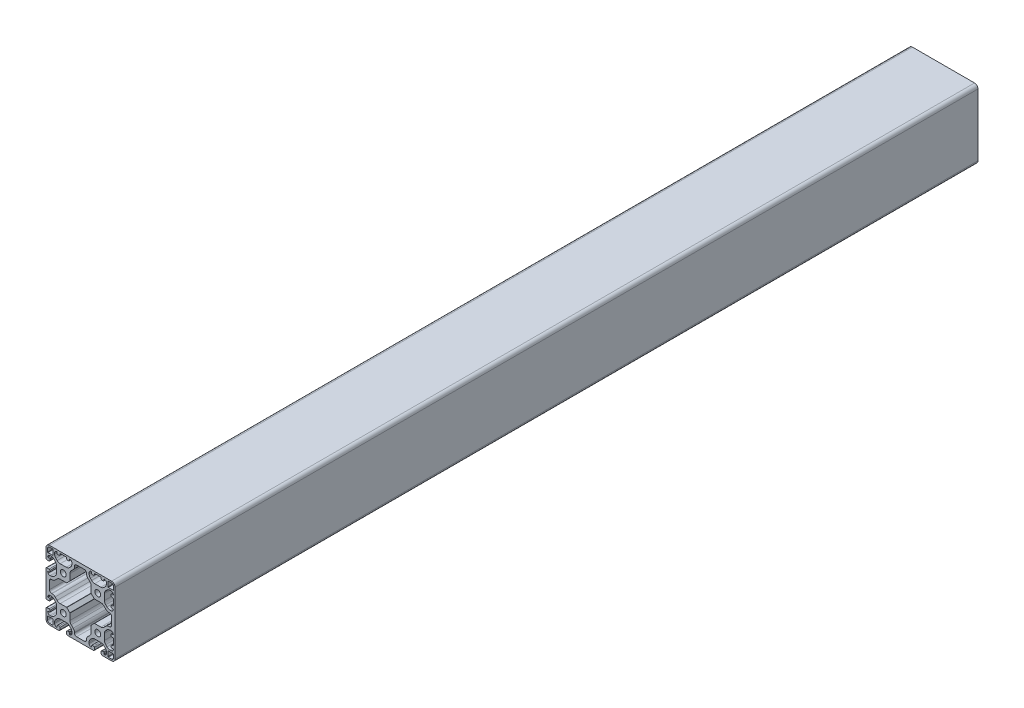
from build123d import *

# Parameters (mm, degrees)
MODEL1_R               = 3.4
STRUKTURBAUTEIL1_DEPTH = 1000


with BuildPart() as part:
    # Model1 → Strukturbauteil1 (new body)
    with BuildSketch(Plane(origin=(0, 0, 0), x_dir=(0, -1, 0), z_dir=(0, 0, -1))):
        with BuildLine():
            Line((30.65685225, -28.53553175), (29.21446125, -27.09314275))
            ThreePointArc((29.21446125, -27.09314275), (28.130599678, -25.471025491), (27.74999925, -23.55760875))
            Line((27.74999925, -23.55760875), (27.74999925, -16.44238675))
            ThreePointArc((27.74999925, -16.44238675), (28.130603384, -14.528969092), (29.21446925, -12.90685275))
            Line((29.21446925, -12.90685275), (30.65685225, -11.46446375))
            ThreePointArc((30.65685225, -11.46446375), (32.278970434, -10.380599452), (34.19238925, -9.99999775))
            Line((34.19238925, -9.99999775), (35.49999925, -9.99999775))
            ThreePointArc((35.49999925, -9.99999775), (37.267766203, -10.732230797), (37.99999925, -12.49999775))
            Line((37.99999925, -12.49999775), (37.99999925, -12.54999675))
            ThreePointArc((37.99999925, -12.54999675), (37.868198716, -12.868194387), (37.55000225, -12.99999775))
            Line((37.55000225, -12.99999775), (35.99999925, -12.99999775))
            ThreePointArc((35.99999925, -12.99999775), (35.646445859, -13.146444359), (35.49999925, -13.49999775))
            Line((35.49999925, -13.49999775), (35.49999925, -14.99999775))
            ThreePointArc((35.49999925, -14.99999775), (35.792892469, -15.707104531), (36.49999925, -15.99999775))
            Line((36.49999925, -15.99999775), (38.99999925, -15.99999775))
            ThreePointArc((38.99999925, -15.99999775), (39.707106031, -15.707104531), (39.99999925, -14.99999775))
            Line((39.99999925, -14.99999775), (39.99999925, 15.00000225))
            ThreePointArc((39.99999925, 15.00000225), (39.707106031, 15.707109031), (38.99999925, 16.00000225))
            Line((38.99999925, 16.00000225), (36.49999925, 16.00000225))
            ThreePointArc((36.49999925, 16.00000225), (35.792892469, 15.707109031), (35.49999925, 15.00000225))
            Line((35.49999925, 15.00000225), (35.49999925, 13.50000225))
            ThreePointArc((35.49999925, 13.50000225), (35.646445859, 13.146448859), (35.99999925, 13.00000225))
            Line((35.99999925, 13.00000225), (37.55000225, 13.00000225))
            ThreePointArc((37.55000225, 13.00000225), (37.868198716, 12.868198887), (37.99999925, 12.55000125))
            Line((37.99999925, 12.55000125), (37.99999925, 12.50000225))
            ThreePointArc((37.99999925, 12.50000225), (37.267766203, 10.732235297), (35.49999925, 10.00000225))
            Line((35.49999925, 10.00000225), (34.19238925, 10.00000225))
            ThreePointArc((34.19238925, 10.00000225), (32.278970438, 10.380603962), (30.65685225, 11.46446825))
            Line((30.65685225, 11.46446825), (29.21446125, 12.90685525))
            ThreePointArc((29.21446125, 12.90685525), (28.130599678, 14.528972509), (27.74999925, 16.44238925))
            Line((27.74999925, 16.44238925), (27.74999925, 23.55761525))
            ThreePointArc((27.74999925, 23.55761525), (28.130603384, 25.471032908), (29.21446925, 27.09314925))
            Line((29.21446925, 27.09314925), (30.65685225, 28.53554025))
            ThreePointArc((30.65685225, 28.53554025), (32.278970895, 29.619402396), (34.19238925, 30.00000225))
            Line((34.19238925, 30.00000225), (35.49999925, 30.00000225))
            ThreePointArc((35.49999925, 30.00000225), (37.267766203, 29.267769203), (37.99999925, 27.50000225))
            Line((37.99999925, 27.50000225), (37.99999925, 27.44999925))
            ThreePointArc((37.99999925, 27.44999925), (37.868197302, 27.131804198), (37.55000225, 27.00000225))
            Line((37.55000225, 27.00000225), (35.99999925, 27.00000225))
            ThreePointArc((35.99999925, 27.00000225), (35.646445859, 26.853555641), (35.49999925, 26.50000225))
            Line((35.49999925, 26.50000225), (35.49999925, 25.00000225))
            ThreePointArc((35.49999925, 25.00000225), (35.792892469, 24.292895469), (36.49999925, 24.00000225))
            Line((36.49999925, 24.00000225), (38.99999925, 24.00000225))
            ThreePointArc((38.99999925, 24.00000225), (39.70710691, 24.292893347), (40.00000225, 24.99999925))
            Line((40.00000225, 24.99999925), (40.00000225, 35.99999925))
            ThreePointArc((40.00000225, 35.99999925), (38.828428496, 38.828425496), (36.00000225, 39.99999925))
            Line((36.00000225, 39.99999925), (25.00000225, 39.99999925))
            ThreePointArc((25.00000225, 39.99999925), (24.292895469, 39.707106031), (24.00000225, 38.99999925))
            Line((24.00000225, 38.99999925), (24.00000225, 36.49999925))
            ThreePointArc((24.00000225, 36.49999925), (24.292895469, 35.792892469), (25.00000225, 35.49999925))
            Line((25.00000225, 35.49999925), (26.50000225, 35.49999925))
            ThreePointArc((26.50000225, 35.49999925), (26.853555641, 35.646445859), (27.00000225, 35.99999925))
            Line((27.00000225, 35.99999925), (27.00000225, 37.55000225))
            ThreePointArc((27.00000225, 37.55000225), (27.131804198, 37.868197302), (27.44999925, 37.99999925))
            Line((27.44999925, 37.99999925), (27.50000225, 37.99999925))
            ThreePointArc((27.50000225, 37.99999925), (29.267769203, 37.267766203), (30.00000225, 35.49999925))
            Line((30.00000225, 35.49999925), (30.00000225, 34.19238925))
            ThreePointArc((30.00000225, 34.19238925), (29.619402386, 32.278970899), (28.53554025, 30.65685225))
            Line((28.53554025, 30.65685225), (27.09314925, 29.21446125))
            ThreePointArc((27.09314925, 29.21446125), (25.471031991, 28.130599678), (23.55761525, 27.74999925))
            Line((23.55761525, 27.74999925), (16.44238925, 27.74999925))
            ThreePointArc((16.44238925, 27.74999925), (14.528971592, 28.130603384), (12.90685525, 29.21446925))
            Line((12.90685525, 29.21446925), (11.46446825, 30.65685225))
            ThreePointArc((11.46446825, 30.65685225), (10.380603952, 32.278970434), (10.00000225, 34.19238925))
            Line((10.00000225, 34.19238925), (10.00000225, 35.49999925))
            ThreePointArc((10.00000225, 35.49999925), (10.732235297, 37.267766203), (12.50000225, 37.99999925))
            Line((12.50000225, 37.99999925), (12.55000125, 37.99999925))
            ThreePointArc((12.55000125, 37.99999925), (12.868198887, 37.868198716), (13.00000225, 37.55000225))
            Line((13.00000225, 37.55000225), (13.00000225, 35.99999925))
            ThreePointArc((13.00000225, 35.99999925), (13.146448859, 35.646445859), (13.50000225, 35.49999925))
            Line((13.50000225, 35.49999925), (15.00000225, 35.49999925))
            ThreePointArc((15.00000225, 35.49999925), (15.707109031, 35.792892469), (16.00000225, 36.49999925))
            Line((16.00000225, 36.49999925), (16.00000225, 38.99999925))
            ThreePointArc((16.00000225, 38.99999925), (15.707109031, 39.707106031), (15.00000225, 39.99999925))
            Line((15.00000225, 39.99999925), (-14.99999775, 39.99999925))
            ThreePointArc((-14.99999775, 39.99999925), (-15.707104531, 39.707106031), (-15.99999775, 38.99999925))
            Line((-15.99999775, 38.99999925), (-15.99999775, 36.49999925))
            ThreePointArc((-15.99999775, 36.49999925), (-15.707104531, 35.792892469), (-14.99999775, 35.49999925))
            Line((-14.99999775, 35.49999925), (-13.49999775, 35.49999925))
            ThreePointArc((-13.49999775, 35.49999925), (-13.146444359, 35.646445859), (-12.99999775, 35.99999925))
            Line((-12.99999775, 35.99999925), (-12.99999775, 37.55000225))
            ThreePointArc((-12.99999775, 37.55000225), (-12.868194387, 37.868198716), (-12.54999675, 37.99999925))
            Line((-12.54999675, 37.99999925), (-12.49999775, 37.99999925))
            ThreePointArc((-12.49999775, 37.99999925), (-10.732230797, 37.267766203), (-9.99999775, 35.49999925))
            Line((-9.99999775, 35.49999925), (-9.99999775, 34.19238925))
            ThreePointArc((-9.99999775, 34.19238925), (-10.380599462, 32.278970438), (-11.46446375, 30.65685225))
            Line((-11.46446375, 30.65685225), (-12.90685275, 29.21446125))
            ThreePointArc((-12.90685275, 29.21446125), (-14.528970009, 28.130599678), (-16.44238675, 27.74999925))
            Line((-16.44238675, 27.74999925), (-23.55760875, 27.74999925))
            ThreePointArc((-23.55760875, 27.74999925), (-25.471026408, 28.130603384), (-27.09314275, 29.21446925))
            Line((-27.09314275, 29.21446925), (-28.53553175, 30.65685225))
            ThreePointArc((-28.53553175, 30.65685225), (-29.619396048, 32.278970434), (-29.99999775, 34.19238925))
            Line((-29.99999775, 34.19238925), (-29.99999775, 35.49999925))
            ThreePointArc((-29.99999775, 35.49999925), (-29.267764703, 37.267766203), (-27.49999775, 37.99999925))
            Line((-27.49999775, 37.99999925), (-27.44999775, 37.99999925))
            ThreePointArc((-27.44999775, 37.99999925), (-27.131800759, 37.868198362), (-26.99999775, 37.55000225))
            Line((-26.99999775, 37.55000225), (-26.99999775, 35.99999925))
            ThreePointArc((-26.99999775, 35.99999925), (-26.853551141, 35.646445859), (-26.49999775, 35.49999925))
            Line((-26.49999775, 35.49999925), (-24.99999775, 35.49999925))
            ThreePointArc((-24.99999775, 35.49999925), (-24.292890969, 35.792892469), (-23.99999775, 36.49999925))
            Line((-23.99999775, 36.49999925), (-23.99999775, 38.99999925))
            ThreePointArc((-23.99999775, 38.99999925), (-24.292890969, 39.707106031), (-24.99999775, 39.99999925))
            Line((-24.99999775, 39.99999925), (-35.99999775, 39.99999925))
            ThreePointArc((-35.99999775, 39.99999925), (-38.828424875, 38.828426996), (-39.99999925, 36.00000075))
            Line((-39.99999925, 36.00000075), (-39.99999925, -35.99999925))
            ThreePointArc((-39.99999925, -35.99999925), (-38.828426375, -38.828426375), (-35.99999925, -39.99999925))
            Line((-35.99999925, -39.99999925), (36.00000075, -39.99999925))
            ThreePointArc((36.00000075, -39.99999925), (38.828426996, -38.828424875), (39.99999925, -35.99999775))
            Line((39.99999925, -35.99999775), (39.99999925, -24.99999775))
            ThreePointArc((39.99999925, -24.99999775), (39.707106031, -24.292890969), (38.99999925, -23.99999775))
            Line((38.99999925, -23.99999775), (36.49999925, -23.99999775))
            ThreePointArc((36.49999925, -23.99999775), (35.792892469, -24.292890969), (35.49999925, -24.99999775))
            Line((35.49999925, -24.99999775), (35.49999925, -26.49999775))
            ThreePointArc((35.49999925, -26.49999775), (35.646445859, -26.853551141), (35.99999925, -26.99999775))
            Line((35.99999925, -26.99999775), (37.55000225, -26.99999775))
            ThreePointArc((37.55000225, -26.99999775), (37.868198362, -27.131800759), (37.99999925, -27.44999775))
            Line((37.99999925, -27.44999775), (37.99999925, -27.49999775))
            ThreePointArc((37.99999925, -27.49999775), (37.267766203, -29.267764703), (35.49999925, -29.99999775))
            Line((35.49999925, -29.99999775), (34.19238925, -29.99999775))
            ThreePointArc((34.19238925, -29.99999775), (32.278970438, -29.619396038), (30.65685225, -28.53553175))
        make_face()
        with Locations((-19.99999925, -19.99999925)):
            Circle(MODEL1_R, mode=Mode.SUBTRACT)
        with Locations((-19.99999925, 20.00000075)):
            Circle(MODEL1_R, mode=Mode.SUBTRACT)
        with Locations((20.00000075, -19.99999925)):
            Circle(MODEL1_R, mode=Mode.SUBTRACT)
        with Locations((20.00000075, 20.00000075)):
            Circle(MODEL1_R, mode=Mode.SUBTRACT)
        with BuildLine():
            Line((-29.21446525, 27.09314775), (-30.65685425, 28.53553875))
            ThreePointArc((-30.65685425, 28.53553875), (-32.278971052, 29.61940012), (-34.19238725, 30.00000075))
            Line((-34.19238725, 30.00000075), (-35.49999925, 30.00000075))
            ThreePointArc((-35.49999925, 30.00000075), (-37.267766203, 29.267767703), (-37.99999925, 27.50000075))
            ThreePointArc((-37.99999925, 27.50000075), (-37.853552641, 27.146447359), (-37.49999925, 27.00000075))
            Line((-37.49999925, 27.00000075), (-35.99999925, 27.00000075))
            ThreePointArc((-35.99999925, 27.00000075), (-35.646445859, 26.853554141), (-35.49999925, 26.50000075))
            Line((-35.49999925, 26.50000075), (-35.49999925, 25.00000075))
            ThreePointArc((-35.49999925, 25.00000075), (-35.792892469, 24.292893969), (-36.49999925, 24.00000075))
            Line((-36.49999925, 24.00000075), (-37.49999925, 24.00000075))
            ThreePointArc((-37.49999925, 24.00000075), (-37.853552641, 23.853554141), (-37.99999925, 23.50000075))
            Line((-37.99999925, 23.50000075), (-37.99999925, 16.50000075))
            ThreePointArc((-37.99999925, 16.50000075), (-37.853552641, 16.146447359), (-37.49999925, 16.00000075))
            Line((-37.49999925, 16.00000075), (-36.49999925, 16.00000075))
            ThreePointArc((-36.49999925, 16.00000075), (-35.792892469, 15.707107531), (-35.49999925, 15.00000075))
            Line((-35.49999925, 15.00000075), (-35.49999925, 13.50000075))
            ThreePointArc((-35.49999925, 13.50000075), (-35.646445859, 13.146447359), (-35.99999925, 13.00000075))
            Line((-35.99999925, 13.00000075), (-37.49999925, 13.00000075))
            ThreePointArc((-37.49999925, 13.00000075), (-37.853552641, 12.853554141), (-37.99999925, 12.50000075))
            ThreePointArc((-37.99999925, 12.50000075), (-37.267766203, 10.732233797), (-35.49999925, 10.00000075))
            Line((-35.49999925, 10.00000075), (-34.19238725, 10.00000075))
            ThreePointArc((-34.19238725, 10.00000075), (-32.278970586, 10.380603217), (-30.65685425, 11.46446675))
            Line((-30.65685425, 11.46446675), (-29.21446525, 12.90685375))
            ThreePointArc((-29.21446525, 12.90685375), (-28.130601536, 14.528970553), (-27.74999925, 16.44238775))
            Line((-27.74999925, 16.44238775), (-27.74999925, 23.55761375))
            ThreePointArc((-27.74999925, 23.55761375), (-28.130601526, 25.471030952), (-29.21446525, 27.09314775))
        make_face(mode=Mode.SUBTRACT)
        with BuildLine():
            Line((-11.46446525, -30.65685425), (-12.90685425, -29.21446525))
            ThreePointArc((-12.90685425, -29.21446525), (-14.528971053, -28.130601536), (-16.44238825, -27.74999925))
            Line((-16.44238825, -27.74999925), (-23.55761025, -27.74999925))
            ThreePointArc((-23.55761025, -27.74999925), (-25.471027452, -28.130601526), (-27.09314425, -29.21446525))
            Line((-27.09314425, -29.21446525), (-28.53553325, -30.65685425))
            ThreePointArc((-28.53553325, -30.65685425), (-29.619396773, -32.278970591), (-29.99999925, -34.19238725))
            Line((-29.99999925, -34.19238725), (-29.99999925, -35.49999925))
            ThreePointArc((-29.99999925, -35.49999925), (-29.267766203, -37.267766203), (-27.49999925, -37.99999925))
            ThreePointArc((-27.49999925, -37.99999925), (-27.146445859, -37.853552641), (-26.99999925, -37.49999925))
            Line((-26.99999925, -37.49999925), (-26.99999925, -35.99999925))
            ThreePointArc((-26.99999925, -35.99999925), (-26.853552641, -35.646445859), (-26.49999925, -35.49999925))
            Line((-26.49999925, -35.49999925), (-24.99999925, -35.49999925))
            ThreePointArc((-24.99999925, -35.49999925), (-24.292892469, -35.792892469), (-23.99999925, -36.49999925))
            Line((-23.99999925, -36.49999925), (-23.99999925, -37.49999925))
            ThreePointArc((-23.99999925, -37.49999925), (-23.853552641, -37.853552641), (-23.49999925, -37.99999925))
            Line((-23.49999925, -37.99999925), (-16.49999925, -37.99999925))
            ThreePointArc((-16.49999925, -37.99999925), (-16.146445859, -37.853552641), (-15.99999925, -37.49999925))
            Line((-15.99999925, -37.49999925), (-15.99999925, -36.49999925))
            ThreePointArc((-15.99999925, -36.49999925), (-15.707106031, -35.792892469), (-14.99999925, -35.49999925))
            Line((-14.99999925, -35.49999925), (-13.49999925, -35.49999925))
            ThreePointArc((-13.49999925, -35.49999925), (-13.146445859, -35.646445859), (-12.99999925, -35.99999925))
            Line((-12.99999925, -35.99999925), (-12.99999925, -37.49999925))
            ThreePointArc((-12.99999925, -37.49999925), (-12.853552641, -37.853552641), (-12.49999925, -37.99999925))
            ThreePointArc((-12.49999925, -37.99999925), (-10.732232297, -37.267766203), (-9.99999925, -35.49999925))
            Line((-9.99999925, -35.49999925), (-9.99999925, -34.19238725))
            ThreePointArc((-9.99999925, -34.19238725), (-10.380601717, -32.278970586), (-11.46446525, -30.65685425))
        make_face(mode=Mode.SUBTRACT)
        with BuildLine():
            Line((-27.09314425, -10.78553325), (-29.41421225, -8.46446525))
            ThreePointArc((-29.41421225, -8.46446525), (-31.036329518, -7.380601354), (-32.94974725, -6.99999925))
            Line((-32.94974725, -6.99999925), (-33.49999925, -6.99999925))
            ThreePointArc((-33.49999925, -6.99999925), (-35.266966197, -6.266966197), (-35.99999925, -4.49999925))
            Line((-35.99999925, -4.49999925), (-35.99999925, 4.50000075))
            ThreePointArc((-35.99999925, 4.50000075), (-35.267766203, 6.267767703), (-33.49999925, 7.00000075))
            Line((-33.49999925, 7.00000075), (-32.94974725, 7.00000075))
            ThreePointArc((-32.94974725, 7.00000075), (-31.974295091, 7.096074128), (-31.036328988, 7.380602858))
            ThreePointArc((-31.036328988, 7.380602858), (-30.171894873, 7.842652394), (-29.414212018, 8.464466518))
            Line((-29.414212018, 8.464466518), (-27.093144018, 10.785534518))
            ThreePointArc((-27.093144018, 10.785534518), (-25.471027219, 11.869398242), (-23.557610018, 12.250000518))
            Line((-23.557610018, 12.250000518), (-16.241378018, 12.250000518))
            ThreePointArc((-16.241378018, 12.250000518), (-16.050036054, 12.288060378), (-15.887824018, 12.396446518))
            Line((-15.887824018, 12.396446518), (-12.396445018, 15.887825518))
            ThreePointArc((-12.396445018, 15.887825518), (-12.288058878, 16.050037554), (-12.249999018, 16.241379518))
            Line((-12.249999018, 16.241379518), (-12.249999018, 23.557613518))
            ThreePointArc((-12.249999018, 23.557613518), (-12.153925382, 24.533064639), (-11.869396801, 25.471029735))
            ThreePointArc((-11.869396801, 25.471029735), (-11.40734705, 26.3354641), (-10.785532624, 27.093147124))
            Line((-10.785532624, 27.093147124), (-8.464464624, 29.414215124))
            ThreePointArc((-8.464464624, 29.414215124), (-7.380601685, 31.036330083), (-6.999998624, 32.949745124))
            Line((-6.999998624, 32.949745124), (-6.999998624, 33.500000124))
            ThreePointArc((-6.999998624, 33.500000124), (-6.267765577, 35.267767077), (-4.499998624, 36.000000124))
            Line((-4.499998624, 36.000000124), (4.500001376, 36.000000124))
            ThreePointArc((4.500001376, 36.000000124), (6.267768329, 35.267767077), (7.000001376, 33.500000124))
            Line((7.000001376, 33.500000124), (7.000001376, 32.949745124))
            ThreePointArc((7.000001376, 32.949745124), (7.096075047, 31.974294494), (7.380603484, 31.036329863))
            ThreePointArc((7.380603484, 31.036329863), (7.842652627, 30.171896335), (8.464466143, 29.414213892))
            Line((8.464466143, 29.414213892), (10.785534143, 27.093145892))
            ThreePointArc((10.785534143, 27.093145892), (11.869397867, 25.471029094), (12.250000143, 23.557611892))
            Line((12.250000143, 23.557611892), (12.250000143, 16.241377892))
            ThreePointArc((12.250000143, 16.241377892), (12.288060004, 16.050035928), (12.396446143, 15.887823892))
            Line((12.396446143, 15.887823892), (15.887825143, 12.396444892))
            ThreePointArc((15.887825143, 12.396444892), (16.05003718, 12.288058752), (16.241379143, 12.249998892))
            Line((16.241379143, 12.249998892), (23.557613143, 12.249998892))
            ThreePointArc((23.557613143, 12.249998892), (24.533064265, 12.153925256), (25.47102936, 11.869396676))
            ThreePointArc((25.47102936, 11.869396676), (26.335463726, 11.407346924), (27.09314675, 10.785532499))
            Line((27.09314675, 10.785532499), (29.41421475, 8.464464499))
            ThreePointArc((29.41421475, 8.464464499), (31.036329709, 7.380601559), (32.94974475, 6.999998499))
            Line((32.94974475, 6.999998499), (33.49999975, 6.999998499))
            ThreePointArc((33.49999975, 6.999998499), (35.267766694, 6.267766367), (36.000000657, 4.500000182))
            Line((36.000000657, 4.500000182), (36.000000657, -4.499999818))
            ThreePointArc((36.000000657, -4.499999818), (35.26776761, -6.267766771), (33.500000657, -6.999999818))
            Line((33.500000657, -6.999999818), (32.949745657, -6.999999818))
            ThreePointArc((32.949745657, -6.999999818), (31.974295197, -7.096073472), (31.036330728, -7.38060186))
            ThreePointArc((31.036330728, -7.38060186), (30.171897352, -7.842650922), (29.414215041, -8.464464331))
            Line((29.414215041, -8.464464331), (27.093147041, -10.785532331))
            ThreePointArc((27.093147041, -10.785532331), (25.471030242, -11.869396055), (23.557613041, -12.249998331))
            Line((23.557613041, -12.249998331), (16.241379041, -12.249998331))
            ThreePointArc((16.241379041, -12.249998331), (16.050037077, -12.288058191), (15.887825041, -12.396444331))
            Line((15.887825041, -12.396444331), (12.396446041, -15.887823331))
            ThreePointArc((12.396446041, -15.887823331), (12.288059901, -16.050035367), (12.250000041, -16.241377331))
            Line((12.250000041, -16.241377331), (12.250000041, -23.557609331))
            ThreePointArc((12.250000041, -23.557609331), (12.153926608, -24.533061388), (11.869397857, -25.471027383))
            ThreePointArc((11.869397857, -25.471027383), (11.407348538, -26.335461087), (10.785534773, -27.093143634))
            Line((10.785534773, -27.093143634), (8.464466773, -29.414211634))
            ThreePointArc((8.464466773, -29.414211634), (7.380602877, -31.036328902), (7.000000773, -32.949746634))
            Line((7.000000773, -32.949746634), (7.000000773, -33.499998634))
            ThreePointArc((7.000000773, -33.499998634), (6.267767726, -35.267765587), (4.500000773, -35.999998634))
            Line((4.500000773, -35.999998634), (-4.499999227, -35.999998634))
            ThreePointArc((-4.499999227, -35.999998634), (-6.26776618, -35.267765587), (-6.999999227, -33.499998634))
            Line((-6.999999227, -33.499998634), (-6.999999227, -32.949746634))
            ThreePointArc((-6.999999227, -32.949746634), (-7.096072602, -31.974294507), (-7.380601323, -31.036328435))
            ThreePointArc((-7.380601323, -31.036328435), (-7.842650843, -30.171894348), (-8.464464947, -29.414211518))
            Line((-8.464464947, -29.414211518), (-10.785532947, -27.093143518))
            ThreePointArc((-10.785532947, -27.093143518), (-11.869396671, -25.471026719), (-12.249998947, -23.557609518))
            Line((-12.249998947, -23.557609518), (-12.249998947, -16.241377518))
            ThreePointArc((-12.249998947, -16.241377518), (-12.288058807, -16.050035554), (-12.396444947, -15.887823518))
            Line((-12.396444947, -15.887823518), (-15.887823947, -12.396444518))
            ThreePointArc((-15.887823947, -12.396444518), (-16.050035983, -12.288058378), (-16.241377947, -12.249998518))
            Line((-16.241377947, -12.249998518), (-23.557609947, -12.249998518))
            ThreePointArc((-23.557609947, -12.249998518), (-24.533062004, -12.153925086), (-25.471028, -11.869396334))
            ThreePointArc((-25.471028, -11.869396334), (-26.335461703, -11.407347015), (-27.09314425, -10.78553325))
        make_face(mode=Mode.SUBTRACT)
        with BuildLine():
            Line((-29.21446525, -12.90685425), (-30.65685425, -11.46446525))
            ThreePointArc((-30.65685425, -11.46446525), (-32.278970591, -10.380601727), (-34.19238725, -9.99999925))
            Line((-34.19238725, -9.99999925), (-35.49999925, -9.99999925))
            ThreePointArc((-35.49999925, -9.99999925), (-37.267766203, -10.732232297), (-37.99999925, -12.49999925))
            ThreePointArc((-37.99999925, -12.49999925), (-37.853552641, -12.853552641), (-37.49999925, -12.99999925))
            Line((-37.49999925, -12.99999925), (-35.99999925, -12.99999925))
            ThreePointArc((-35.99999925, -12.99999925), (-35.646445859, -13.146445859), (-35.49999925, -13.49999925))
            Line((-35.49999925, -13.49999925), (-35.49999925, -14.99999925))
            ThreePointArc((-35.49999925, -14.99999925), (-35.792892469, -15.707106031), (-36.49999925, -15.99999925))
            Line((-36.49999925, -15.99999925), (-37.49999925, -15.99999925))
            ThreePointArc((-37.49999925, -15.99999925), (-37.853552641, -16.146445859), (-37.99999925, -16.49999925))
            Line((-37.99999925, -16.49999925), (-37.99999925, -23.49999925))
            ThreePointArc((-37.99999925, -23.49999925), (-37.853552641, -23.853552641), (-37.49999925, -23.99999925))
            Line((-37.49999925, -23.99999925), (-36.49999925, -23.99999925))
            ThreePointArc((-36.49999925, -23.99999925), (-35.792892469, -24.292892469), (-35.49999925, -24.99999925))
            Line((-35.49999925, -24.99999925), (-35.49999925, -26.49999925))
            ThreePointArc((-35.49999925, -26.49999925), (-35.646445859, -26.853552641), (-35.99999925, -26.99999925))
            Line((-35.99999925, -26.99999925), (-37.49999925, -26.99999925))
            ThreePointArc((-37.49999925, -26.99999925), (-37.853552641, -27.146445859), (-37.99999925, -27.49999925))
            ThreePointArc((-37.99999925, -27.49999925), (-37.267766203, -29.267766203), (-35.49999925, -29.99999925))
            Line((-35.49999925, -29.99999925), (-34.19238725, -29.99999925))
            ThreePointArc((-34.19238725, -29.99999925), (-32.278970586, -29.619396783), (-30.65685425, -28.53553325))
            Line((-30.65685425, -28.53553325), (-29.21446525, -27.09314425))
            ThreePointArc((-29.21446525, -27.09314425), (-28.130601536, -25.471027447), (-27.74999925, -23.55761025))
            Line((-27.74999925, -23.55761025), (-27.74999925, -16.44238825))
            ThreePointArc((-27.74999925, -16.44238825), (-28.130601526, -14.528971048), (-29.21446525, -12.90685425))
        make_face(mode=Mode.SUBTRACT)
        with BuildLine():
            Line((28.53553875, -30.65685425), (27.09314775, -29.21446525))
            ThreePointArc((27.09314775, -29.21446525), (25.471030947, -28.130601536), (23.55761375, -27.74999925))
            Line((23.55761375, -27.74999925), (16.44238775, -27.74999925))
            ThreePointArc((16.44238775, -27.74999925), (14.528970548, -28.130601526), (12.90685375, -29.21446525))
            Line((12.90685375, -29.21446525), (11.46446675, -30.65685425))
            ThreePointArc((11.46446675, -30.65685425), (10.380603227, -32.278970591), (10.00000075, -34.19238725))
            Line((10.00000075, -34.19238725), (10.00000075, -35.49999925))
            ThreePointArc((10.00000075, -35.49999925), (10.732233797, -37.267766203), (12.50000075, -37.99999925))
            ThreePointArc((12.50000075, -37.99999925), (12.853554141, -37.853552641), (13.00000075, -37.49999925))
            Line((13.00000075, -37.49999925), (13.00000075, -35.99999925))
            ThreePointArc((13.00000075, -35.99999925), (13.146447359, -35.646445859), (13.50000075, -35.49999925))
            Line((13.50000075, -35.49999925), (15.00000075, -35.49999925))
            ThreePointArc((15.00000075, -35.49999925), (15.707107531, -35.792892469), (16.00000075, -36.49999925))
            Line((16.00000075, -36.49999925), (16.00000075, -37.49999925))
            ThreePointArc((16.00000075, -37.49999925), (16.146447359, -37.853552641), (16.50000075, -37.99999925))
            Line((16.50000075, -37.99999925), (23.50000075, -37.99999925))
            ThreePointArc((23.50000075, -37.99999925), (23.853554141, -37.853552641), (24.00000075, -37.49999925))
            Line((24.00000075, -37.49999925), (24.00000075, -36.49999925))
            ThreePointArc((24.00000075, -36.49999925), (24.292893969, -35.792892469), (25.00000075, -35.49999925))
            Line((25.00000075, -35.49999925), (26.50000075, -35.49999925))
            ThreePointArc((26.50000075, -35.49999925), (26.853554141, -35.646445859), (27.00000075, -35.99999925))
            Line((27.00000075, -35.99999925), (27.00000075, -37.49999925))
            ThreePointArc((27.00000075, -37.49999925), (27.146447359, -37.853552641), (27.50000075, -37.99999925))
            ThreePointArc((27.50000075, -37.99999925), (29.267767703, -37.267766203), (30.00000075, -35.49999925))
            Line((30.00000075, -35.49999925), (30.00000075, -34.19238725))
            ThreePointArc((30.00000075, -34.19238725), (29.61940013, -32.278971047), (28.53553875, -30.65685425))
        make_face(mode=Mode.SUBTRACT)
        with BuildLine():
            Line((32.30000375, -38.19999775), (36.00000075, -38.19999775))
            ThreePointArc((36.00000075, -38.19999775), (37.555633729, -37.555631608), (38.19999775, -35.99999775))
            Line((38.19999775, -35.99999775), (38.19999775, -32.29999775))
            ThreePointArc((38.19999775, -32.29999775), (38.053551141, -31.946444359), (37.69999775, -31.79999775))
            Line((37.69999775, -31.79999775), (32.30000375, -31.79999775))
            ThreePointArc((32.30000375, -31.79999775), (31.946450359, -31.946444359), (31.80000375, -32.29999775))
            Line((31.80000375, -32.29999775), (31.80000375, -37.69999775))
            ThreePointArc((31.80000375, -37.69999775), (31.946450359, -38.053551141), (32.30000375, -38.19999775))
        make_face(mode=Mode.SUBTRACT)
        with BuildLine():
            Line((-35.99999925, -38.19999925), (-32.29999925, -38.19999925))
            ThreePointArc((-32.29999925, -38.19999925), (-31.946445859, -38.053552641), (-31.79999925, -37.69999925))
            Line((-31.79999925, -37.69999925), (-31.79999925, -32.29999925))
            ThreePointArc((-31.79999925, -32.29999925), (-31.946445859, -31.946445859), (-32.29999925, -31.79999925))
            Line((-32.29999925, -31.79999925), (-37.69999925, -31.79999925))
            ThreePointArc((-37.69999925, -31.79999925), (-38.053552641, -31.946445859), (-38.19999925, -32.29999925))
            Line((-38.19999925, -32.29999925), (-38.19999925, -35.99999925))
            ThreePointArc((-38.19999925, -35.99999925), (-37.555634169, -37.555634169), (-35.99999925, -38.19999925))
        make_face(mode=Mode.SUBTRACT)
        with BuildLine():
            Line((-37.69999775, 31.80000375), (-32.29999775, 31.80000375))
            ThreePointArc((-32.29999775, 31.80000375), (-31.946444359, 31.946450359), (-31.79999775, 32.30000375))
            Line((-31.79999775, 32.30000375), (-31.79999775, 37.69999775))
            ThreePointArc((-31.79999775, 37.69999775), (-31.946444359, 38.053551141), (-32.29999775, 38.19999775))
            Line((-32.29999775, 38.19999775), (-35.99999775, 38.19999775))
            ThreePointArc((-35.99999775, 38.19999775), (-37.555631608, 37.555633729), (-38.19999775, 36.00000075))
            Line((-38.19999775, 36.00000075), (-38.19999775, 32.30000375))
            ThreePointArc((-38.19999775, 32.30000375), (-38.053551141, 31.946450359), (-37.69999775, 31.80000375))
        make_face(mode=Mode.SUBTRACT)
        with BuildLine():
            Line((32.30000525, 31.80000225), (37.69999925, 31.80000225))
            ThreePointArc((37.69999925, 31.80000225), (38.053552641, 31.946448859), (38.19999925, 32.30000225))
            Line((38.19999925, 32.30000225), (38.19999925, 35.99999925))
            ThreePointArc((38.19999925, 35.99999925), (37.555634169, 37.555631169), (36.00000225, 38.19999625))
            Line((36.00000225, 38.19999625), (32.30000525, 38.19999625))
            ThreePointArc((32.30000525, 38.19999625), (31.946451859, 38.053549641), (31.80000525, 37.69999625))
            Line((31.80000525, 37.69999625), (31.80000525, 32.30000225))
            ThreePointArc((31.80000525, 32.30000225), (31.946451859, 31.946448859), (32.30000525, 31.80000225))
        make_face(mode=Mode.SUBTRACT)
    extrude(amount=STRUKTURBAUTEIL1_DEPTH)


solid = part.part
